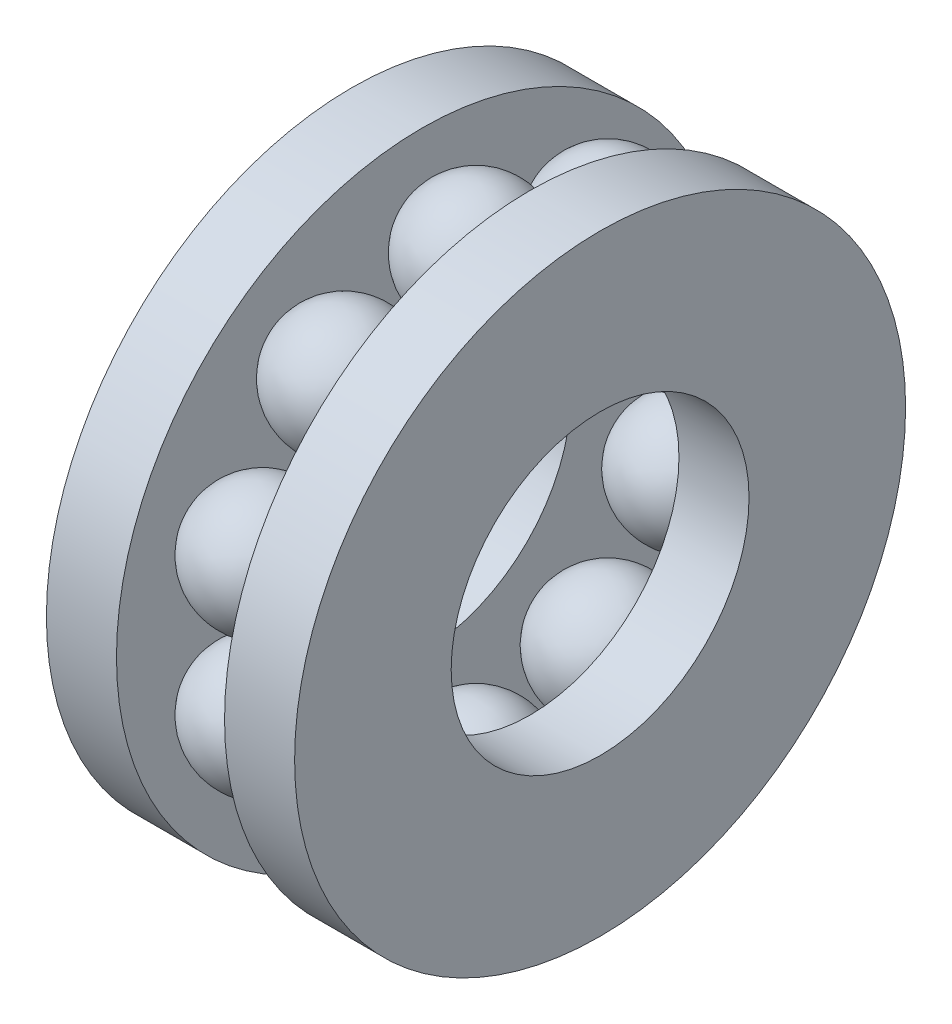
from build123d import *

# Parameters (mm, degrees)
SKETCH1_W         = 18.35
SKETCH1_H         = 41
CIRPATTERN1_COUNT = 10


with BuildPart() as part:
    # Sketch1 → Revolve1 (revolve)
    with BuildSketch(Plane.XY, mode=Mode.PRIVATE) as revolve1_sk:
        with Locations((-9.175, 59.5)):
            Rectangle(SKETCH1_W, SKETCH1_H)
        with Locations((-55.825, 59.5)):
            Rectangle(SKETCH1_W, SKETCH1_H)
    revolve(revolve1_sk.sketch.rotate(Axis((0, 0, 0), (-1, 0, 0)), 90), axis=Axis((0, 0, 0), (-1, 0, 0)))

    # Sketch2 → Revolve3 (revolve)
    with BuildSketch(Plane.XY):
        with BuildLine():
            Line((-16.25, 58.75), (-48.75, 58.75))
            ThreePointArc((-48.75, 58.75), (-32.5, 75), (-16.25, 58.75))
        make_face()
    revolve3 = revolve(axis=Axis((-16.25, 58.75, 0), (-1, 0, 0)))

    # CirPattern1: Revolve3 ×10 about axis
    cirpattern1_axis = Axis((0, 0, 0), (1, 0, 0))
    for i in range(1, CIRPATTERN1_COUNT):
        add(revolve3.rotate(cirpattern1_axis, i * 360 / CIRPATTERN1_COUNT))


solid = part.part
